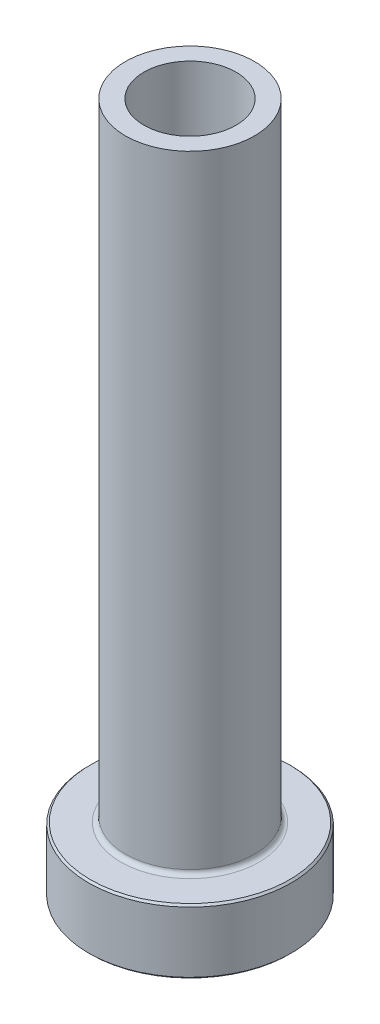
ISO-10303-21;
HEADER;
FILE_DESCRIPTION(('STEP AP214'),'2;1');
FILE_NAME('part.step','',(''),(''),'','','');
FILE_SCHEMA(('AUTOMOTIVE_DESIGN { 1 0 10303 214 1 1 1 1 }'));
ENDSEC;
DATA;
#1=APPLICATION_CONTEXT('core data for automotive mechanical design processes');
#2=APPLICATION_PROTOCOL_DEFINITION('international standard','automotive_design',2000,#1);
#3=PRODUCT_CONTEXT('',#1,'mechanical');
#4=PRODUCT('Part','Part','',(#3));
#5=PRODUCT_RELATED_PRODUCT_CATEGORY('part','',(#4));
#6=PRODUCT_DEFINITION_FORMATION('','',#4);
#7=PRODUCT_DEFINITION_CONTEXT('part definition',#1,'design');
#8=PRODUCT_DEFINITION('design','',#6,#7);
#9=PRODUCT_DEFINITION_SHAPE('','',#8);
#10=(LENGTH_UNIT() NAMED_UNIT(*) SI_UNIT(.MILLI.,.METRE.));
#11=(NAMED_UNIT(*) PLANE_ANGLE_UNIT() SI_UNIT($,.RADIAN.));
#12=(NAMED_UNIT(*) SI_UNIT($,.STERADIAN.) SOLID_ANGLE_UNIT());
#13=UNCERTAINTY_MEASURE_WITH_UNIT(LENGTH_MEASURE(1.E-05),#10,'distance_accuracy_value','');
#14=(GEOMETRIC_REPRESENTATION_CONTEXT(3) GLOBAL_UNCERTAINTY_ASSIGNED_CONTEXT((#13)) GLOBAL_UNIT_ASSIGNED_CONTEXT((#10,
#11,#12)) REPRESENTATION_CONTEXT('',''));
#15=CARTESIAN_POINT('',(0.,0.,0.));
#16=DIRECTION('',(0.,0.,1.));
#17=DIRECTION('',(1.,0.,0.));
#18=AXIS2_PLACEMENT_3D('',#15,#16,#17);
#19=CARTESIAN_POINT('',(0.,92.1876809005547,0.));
#20=DIRECTION('',(0.,1.,0.));
#21=DIRECTION('',(0.,0.,1.));
#22=AXIS2_PLACEMENT_3D('',#19,#20,#21);
#23=CYLINDRICAL_SURFACE('',#22,5.00000000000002);
#24=CARTESIAN_POINT('',(0.,75.,0.));
#25=DIRECTION('',(0.,1.,0.));
#26=DIRECTION('',(0.,0.,1.));
#27=AXIS2_PLACEMENT_3D('',#24,#25,#26);
#28=CIRCLE('',#27,5.00000000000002);
#29=CARTESIAN_POINT('',(0.,75.,5.00000000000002));
#30=VERTEX_POINT('',#29);
#31=EDGE_CURVE('E62',#30,#30,#28,.T.);
#32=ORIENTED_EDGE('',*,*,#31,.T.);
#33=EDGE_LOOP('',(#32));
#34=FACE_BOUND('',#33,.T.);
#35=CARTESIAN_POINT('',(0.,30.,0.));
#36=DIRECTION('',(0.,1.,0.));
#37=DIRECTION('',(0.,0.,1.));
#38=AXIS2_PLACEMENT_3D('',#35,#36,#37);
#39=CIRCLE('',#38,5.00000000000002);
#40=CARTESIAN_POINT('',(0.,30.,5.00000000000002));
#41=VERTEX_POINT('',#40);
#42=EDGE_CURVE('E71',#41,#41,#39,.T.);
#43=ORIENTED_EDGE('',*,*,#42,.F.);
#44=EDGE_LOOP('',(#43));
#45=FACE_BOUND('',#44,.T.);
#46=ADVANCED_FACE('F30',(#34,#45),#23,.F.);
#47=CARTESIAN_POINT('',(-5.00000000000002,75.,0.));
#48=DIRECTION('',(0.,1.,0.));
#49=DIRECTION('',(0.,0.,1.));
#50=AXIS2_PLACEMENT_3D('',#47,#48,#49);
#51=PLANE('',#50);
#52=CARTESIAN_POINT('',(0.,75.,0.));
#53=DIRECTION('',(0.,1.,0.));
#54=DIRECTION('',(0.,0.,1.));
#55=AXIS2_PLACEMENT_3D('',#52,#53,#54);
#56=CIRCLE('',#55,7.);
#57=CARTESIAN_POINT('',(0.,75.,7.));
#58=VERTEX_POINT('',#57);
#59=EDGE_CURVE('E65',#58,#58,#56,.T.);
#60=ORIENTED_EDGE('',*,*,#59,.T.);
#61=EDGE_LOOP('',(#60));
#62=FACE_BOUND('',#61,.T.);
#63=ORIENTED_EDGE('',*,*,#31,.F.);
#64=EDGE_LOOP('',(#63));
#65=FACE_BOUND('',#64,.T.);
#66=ADVANCED_FACE('F79',(#62,#65),#51,.T.);
#67=CARTESIAN_POINT('',(0.,92.1876809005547,0.));
#68=DIRECTION('',(0.,1.,0.));
#69=DIRECTION('',(0.,0.,1.));
#70=AXIS2_PLACEMENT_3D('',#67,#68,#69);
#71=CYLINDRICAL_SURFACE('',#70,6.99999999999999);
#72=CARTESIAN_POINT('',(0.,7.50000000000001,0.));
#73=DIRECTION('',(0.,1.,0.));
#74=DIRECTION('',(0.,0.,1.));
#75=AXIS2_PLACEMENT_3D('',#72,#73,#74);
#76=CIRCLE('',#75,6.99999999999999);
#77=CARTESIAN_POINT('',(0.,7.50000000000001,6.99999999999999));
#78=VERTEX_POINT('',#77);
#79=EDGE_CURVE('E59',#78,#78,#76,.T.);
#80=ORIENTED_EDGE('',*,*,#79,.T.);
#81=EDGE_LOOP('',(#80));
#82=FACE_BOUND('',#81,.T.);
#83=ORIENTED_EDGE('',*,*,#59,.F.);
#84=EDGE_LOOP('',(#83));
#85=FACE_BOUND('',#84,.T.);
#86=ADVANCED_FACE('F85',(#82,#85),#71,.T.);
#87=CARTESIAN_POINT('',(-6.99999999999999,7.,0.));
#88=DIRECTION('',(0.,1.,0.));
#89=DIRECTION('',(0.,0.,1.));
#90=AXIS2_PLACEMENT_3D('',#87,#88,#89);
#91=PLANE('',#90);
#92=CARTESIAN_POINT('',(0.,7.,0.));
#93=DIRECTION('',(0.,1.,0.));
#94=DIRECTION('',(0.,0.,1.));
#95=AXIS2_PLACEMENT_3D('',#92,#93,#94);
#96=CIRCLE('',#95,10.8);
#97=CARTESIAN_POINT('',(0.,7.,10.8));
#98=VERTEX_POINT('',#97);
#99=EDGE_CURVE('E53',#98,#98,#96,.T.);
#100=ORIENTED_EDGE('',*,*,#99,.T.);
#101=EDGE_LOOP('',(#100));
#102=FACE_BOUND('',#101,.T.);
#103=CARTESIAN_POINT('',(0.,7.,0.));
#104=DIRECTION('',(0.,1.,0.));
#105=DIRECTION('',(0.,0.,1.));
#106=AXIS2_PLACEMENT_3D('',#103,#104,#105);
#107=CIRCLE('',#106,7.49999999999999);
#108=CARTESIAN_POINT('',(0.,7.,7.49999999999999));
#109=VERTEX_POINT('',#108);
#110=EDGE_CURVE('E56',#109,#109,#107,.F.);
#111=ORIENTED_EDGE('',*,*,#110,.T.);
#112=EDGE_LOOP('',(#111));
#113=FACE_BOUND('',#112,.T.);
#114=ADVANCED_FACE('F111',(#102,#113),#91,.T.);
#115=CARTESIAN_POINT('',(0.,92.1876809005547,0.));
#116=DIRECTION('',(0.,1.,0.));
#117=DIRECTION('',(0.,0.,1.));
#118=AXIS2_PLACEMENT_3D('',#115,#116,#117);
#119=CYLINDRICAL_SURFACE('',#118,11.);
#120=CARTESIAN_POINT('',(0.,6.80000000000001,0.));
#121=DIRECTION('',(0.,1.,0.));
#122=DIRECTION('',(0.,0.,1.));
#123=AXIS2_PLACEMENT_3D('',#120,#121,#122);
#124=CIRCLE('',#123,11.);
#125=CARTESIAN_POINT('',(0.,6.80000000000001,11.));
#126=VERTEX_POINT('',#125);
#127=EDGE_CURVE('E45',#126,#126,#124,.F.);
#128=ORIENTED_EDGE('',*,*,#127,.T.);
#129=EDGE_LOOP('',(#128));
#130=FACE_BOUND('',#129,.T.);
#131=CARTESIAN_POINT('',(0.,0.200000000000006,0.));
#132=DIRECTION('',(0.,-1.,0.));
#133=DIRECTION('',(0.,0.,-1.));
#134=AXIS2_PLACEMENT_3D('',#131,#132,#133);
#135=CIRCLE('',#134,11.);
#136=CARTESIAN_POINT('',(0.,0.200000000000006,-11.));
#137=VERTEX_POINT('',#136);
#138=EDGE_CURVE('E50',#137,#137,#135,.F.);
#139=ORIENTED_EDGE('',*,*,#138,.T.);
#140=EDGE_LOOP('',(#139));
#141=FACE_BOUND('',#140,.T.);
#142=ADVANCED_FACE('F108',(#130,#141),#119,.T.);
#143=CARTESIAN_POINT('',(-11.,0.,0.));
#144=DIRECTION('',(0.,-1.,0.));
#145=DIRECTION('',(0.,0.,-1.));
#146=AXIS2_PLACEMENT_3D('',#143,#144,#145);
#147=PLANE('',#146);
#148=CARTESIAN_POINT('',(0.,0.,0.));
#149=DIRECTION('',(0.,-1.,0.));
#150=DIRECTION('',(0.,0.,-1.));
#151=AXIS2_PLACEMENT_3D('',#148,#149,#150);
#152=CIRCLE('',#151,5.74999999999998);
#153=CARTESIAN_POINT('',(0.,0.,-5.74999999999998));
#154=VERTEX_POINT('',#153);
#155=EDGE_CURVE('E37',#154,#154,#152,.F.);
#156=ORIENTED_EDGE('',*,*,#155,.T.);
#157=EDGE_LOOP('',(#156));
#158=FACE_BOUND('',#157,.T.);
#159=CARTESIAN_POINT('',(0.,0.,0.));
#160=DIRECTION('',(0.,-1.,0.));
#161=DIRECTION('',(0.,0.,-1.));
#162=AXIS2_PLACEMENT_3D('',#159,#160,#161);
#163=CIRCLE('',#162,10.8);
#164=CARTESIAN_POINT('',(0.,0.,-10.8));
#165=VERTEX_POINT('',#164);
#166=EDGE_CURVE('E41',#165,#165,#163,.T.);
#167=ORIENTED_EDGE('',*,*,#166,.T.);
#168=EDGE_LOOP('',(#167));
#169=FACE_BOUND('',#168,.T.);
#170=ADVANCED_FACE('F110',(#158,#169),#147,.T.);
#171=CARTESIAN_POINT('',(0.,92.1876809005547,0.));
#172=DIRECTION('',(0.,1.,0.));
#173=DIRECTION('',(0.,0.,1.));
#174=AXIS2_PLACEMENT_3D('',#171,#172,#173);
#175=CYLINDRICAL_SURFACE('',#174,5.24999999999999);
#176=CARTESIAN_POINT('',(0.,0.499999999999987,0.));
#177=DIRECTION('',(0.,-1.,0.));
#178=DIRECTION('',(0.,0.,-1.));
#179=AXIS2_PLACEMENT_3D('',#176,#177,#178);
#180=CIRCLE('',#179,5.24999999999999);
#181=CARTESIAN_POINT('',(0.,0.499999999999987,-5.24999999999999));
#182=VERTEX_POINT('',#181);
#183=EDGE_CURVE('E10',#182,#182,#180,.T.);
#184=ORIENTED_EDGE('',*,*,#183,.T.);
#185=EDGE_LOOP('',(#184));
#186=FACE_BOUND('',#185,.T.);
#187=CARTESIAN_POINT('',(0.,18.,0.));
#188=DIRECTION('',(0.,1.,0.));
#189=DIRECTION('',(0.,0.,1.));
#190=AXIS2_PLACEMENT_3D('',#187,#188,#189);
#191=CIRCLE('',#190,5.24999999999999);
#192=CARTESIAN_POINT('',(0.,18.,5.24999999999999));
#193=VERTEX_POINT('',#192);
#194=EDGE_CURVE('E68',#193,#193,#191,.T.);
#195=ORIENTED_EDGE('',*,*,#194,.T.);
#196=EDGE_LOOP('',(#195));
#197=FACE_BOUND('',#196,.T.);
#198=ADVANCED_FACE('F118',(#186,#197),#175,.F.);
#199=CARTESIAN_POINT('',(0.,18.,0.));
#200=DIRECTION('',(0.,-1.,0.));
#201=DIRECTION('',(0.,0.,-1.));
#202=AXIS2_PLACEMENT_3D('',#199,#200,#201);
#203=CONICAL_SURFACE('',#202,5.24999999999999,0.0208303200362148);
#204=ORIENTED_EDGE('',*,*,#42,.T.);
#205=EDGE_LOOP('',(#204));
#206=FACE_BOUND('',#205,.T.);
#207=ORIENTED_EDGE('',*,*,#194,.F.);
#208=EDGE_LOOP('',(#207));
#209=FACE_BOUND('',#208,.T.);
#210=ADVANCED_FACE('F75',(#206,#209),#203,.F.);
#211=CARTESIAN_POINT('',(0.,7.50000000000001,0.));
#212=DIRECTION('',(0.,1.,0.));
#213=DIRECTION('',(0.,0.,1.));
#214=AXIS2_PLACEMENT_3D('',#211,#212,#213);
#215=TOROIDAL_SURFACE('',#214,7.49999999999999,0.5);
#216=ORIENTED_EDGE('',*,*,#110,.F.);
#217=EDGE_LOOP('',(#216));
#218=FACE_BOUND('',#217,.T.);
#219=ORIENTED_EDGE('',*,*,#79,.F.);
#220=EDGE_LOOP('',(#219));
#221=FACE_BOUND('',#220,.T.);
#222=ADVANCED_FACE('F90',(#218,#221),#215,.F.);
#223=CARTESIAN_POINT('',(0.,7.00000000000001,0.));
#224=DIRECTION('',(0.,-1.,0.));
#225=DIRECTION('',(0.,0.,-1.));
#226=AXIS2_PLACEMENT_3D('',#223,#224,#225);
#227=CONICAL_SURFACE('',#226,10.8,0.785398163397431);
#228=ORIENTED_EDGE('',*,*,#127,.F.);
#229=EDGE_LOOP('',(#228));
#230=FACE_BOUND('',#229,.T.);
#231=ORIENTED_EDGE('',*,*,#99,.F.);
#232=EDGE_LOOP('',(#231));
#233=FACE_BOUND('',#232,.T.);
#234=ADVANCED_FACE('F93',(#230,#233),#227,.T.);
#235=CARTESIAN_POINT('',(0.,0.200000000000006,0.));
#236=DIRECTION('',(0.,1.,0.));
#237=DIRECTION('',(0.,0.,1.));
#238=AXIS2_PLACEMENT_3D('',#235,#236,#237);
#239=CONICAL_SURFACE('',#238,11.,0.785398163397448);
#240=ORIENTED_EDGE('',*,*,#166,.F.);
#241=EDGE_LOOP('',(#240));
#242=FACE_BOUND('',#241,.T.);
#243=ORIENTED_EDGE('',*,*,#138,.F.);
#244=EDGE_LOOP('',(#243));
#245=FACE_BOUND('',#244,.T.);
#246=ADVANCED_FACE('F96',(#242,#245),#239,.T.);
#247=CARTESIAN_POINT('',(0.,0.,0.));
#248=DIRECTION('',(0.,-1.,0.));
#249=DIRECTION('',(0.,0.,-1.));
#250=AXIS2_PLACEMENT_3D('',#247,#248,#249);
#251=CONICAL_SURFACE('',#250,5.74999999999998,0.785398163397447);
#252=ORIENTED_EDGE('',*,*,#183,.F.);
#253=EDGE_LOOP('',(#252));
#254=FACE_BOUND('',#253,.T.);
#255=ORIENTED_EDGE('',*,*,#155,.F.);
#256=EDGE_LOOP('',(#255));
#257=FACE_BOUND('',#256,.T.);
#258=ADVANCED_FACE('F32',(#254,#257),#251,.F.);
#259=CLOSED_SHELL('',(#46,#66,#86,#114,#142,#170,#198,#210,#222,#234,#246,#258));
#260=MANIFOLD_SOLID_BREP('B2',#259);
#261=ADVANCED_BREP_SHAPE_REPRESENTATION('',(#18,#260),#14);
#262=SHAPE_DEFINITION_REPRESENTATION(#9,#261);
ENDSEC;
END-ISO-10303-21;
